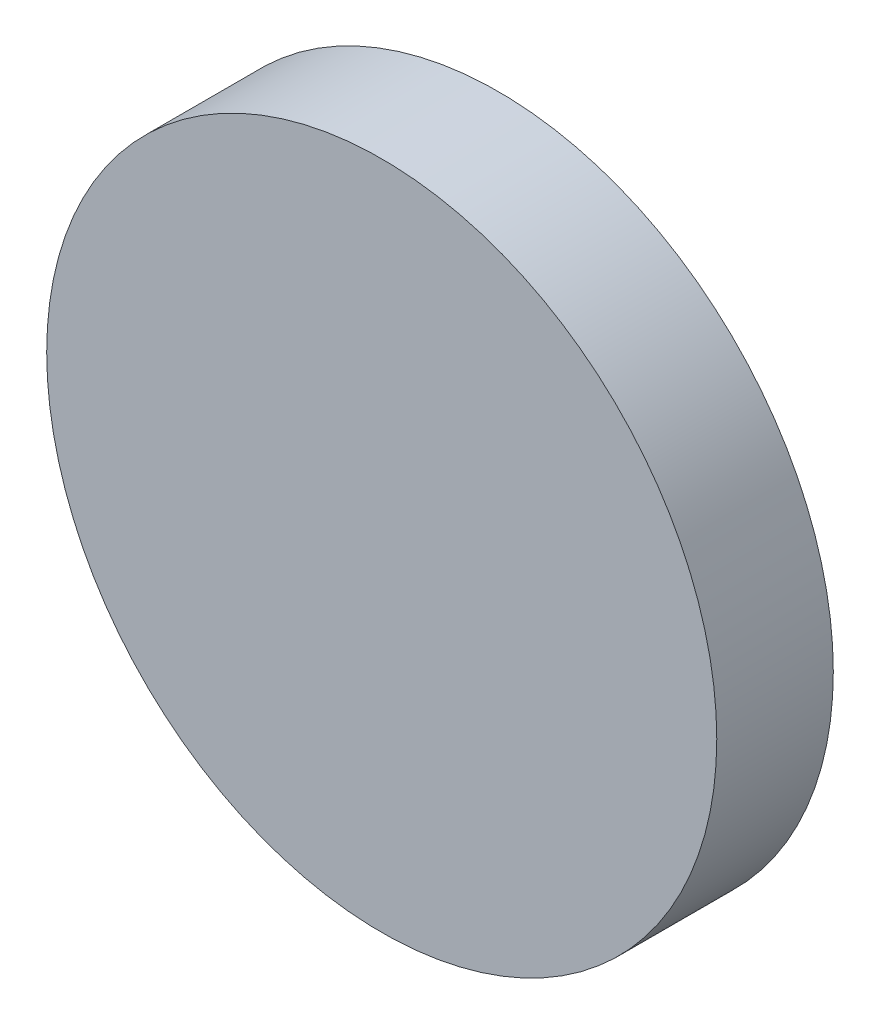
ISO-10303-21;
HEADER;
FILE_DESCRIPTION(('STEP AP214'),'2;1');
FILE_NAME('part.step','',(''),(''),'','','');
FILE_SCHEMA(('AUTOMOTIVE_DESIGN { 1 0 10303 214 1 1 1 1 }'));
ENDSEC;
DATA;
#1=APPLICATION_CONTEXT('core data for automotive mechanical design processes');
#2=APPLICATION_PROTOCOL_DEFINITION('international standard','automotive_design',2000,#1);
#3=PRODUCT_CONTEXT('',#1,'mechanical');
#4=PRODUCT('Part','Part','',(#3));
#5=PRODUCT_RELATED_PRODUCT_CATEGORY('part','',(#4));
#6=PRODUCT_DEFINITION_FORMATION('','',#4);
#7=PRODUCT_DEFINITION_CONTEXT('part definition',#1,'design');
#8=PRODUCT_DEFINITION('design','',#6,#7);
#9=PRODUCT_DEFINITION_SHAPE('','',#8);
#10=(LENGTH_UNIT() NAMED_UNIT(*) SI_UNIT(.MILLI.,.METRE.));
#11=(NAMED_UNIT(*) PLANE_ANGLE_UNIT() SI_UNIT($,.RADIAN.));
#12=(NAMED_UNIT(*) SI_UNIT($,.STERADIAN.) SOLID_ANGLE_UNIT());
#13=UNCERTAINTY_MEASURE_WITH_UNIT(LENGTH_MEASURE(1.E-05),#10,'distance_accuracy_value','');
#14=(GEOMETRIC_REPRESENTATION_CONTEXT(3) GLOBAL_UNCERTAINTY_ASSIGNED_CONTEXT((#13)) GLOBAL_UNIT_ASSIGNED_CONTEXT((#10,
#11,#12)) REPRESENTATION_CONTEXT('',''));
#15=CARTESIAN_POINT('',(0.,0.,0.));
#16=DIRECTION('',(0.,0.,1.));
#17=DIRECTION('',(1.,0.,0.));
#18=AXIS2_PLACEMENT_3D('',#15,#16,#17);
#19=CARTESIAN_POINT('',(0.,0.,8.));
#20=DIRECTION('',(0.,0.,1.));
#21=DIRECTION('',(1.,0.,0.));
#22=AXIS2_PLACEMENT_3D('',#19,#20,#21);
#23=PLANE('',#22);
#24=CARTESIAN_POINT('',(0.,0.,8.));
#25=DIRECTION('',(0.,0.,1.));
#26=DIRECTION('',(1.,0.,0.));
#27=AXIS2_PLACEMENT_3D('',#24,#25,#26);
#28=CIRCLE('',#27,23.);
#29=CARTESIAN_POINT('',(23.,0.,8.));
#30=VERTEX_POINT('',#29);
#31=EDGE_CURVE('E10',#30,#30,#28,.T.);
#32=ORIENTED_EDGE('',*,*,#31,.T.);
#33=EDGE_LOOP('',(#32));
#34=FACE_BOUND('',#33,.T.);
#35=ADVANCED_FACE('F16',(#34),#23,.T.);
#36=CARTESIAN_POINT('',(0.,0.,0.));
#37=DIRECTION('',(0.,0.,1.));
#38=DIRECTION('',(1.,0.,0.));
#39=AXIS2_PLACEMENT_3D('',#36,#37,#38);
#40=PLANE('',#39);
#41=CARTESIAN_POINT('',(0.,0.,0.));
#42=DIRECTION('',(0.,0.,1.));
#43=DIRECTION('',(1.,0.,0.));
#44=AXIS2_PLACEMENT_3D('',#41,#42,#43);
#45=CIRCLE('',#44,23.);
#46=CARTESIAN_POINT('',(23.,0.,0.));
#47=VERTEX_POINT('',#46);
#48=EDGE_CURVE('E41',#47,#47,#45,.T.);
#49=ORIENTED_EDGE('',*,*,#48,.F.);
#50=EDGE_LOOP('',(#49));
#51=FACE_BOUND('',#50,.T.);
#52=ADVANCED_FACE('F55',(#51),#40,.F.);
#53=CARTESIAN_POINT('',(0.,0.,0.));
#54=DIRECTION('',(0.,0.,-1.));
#55=DIRECTION('',(1.,0.,0.));
#56=AXIS2_PLACEMENT_3D('',#53,#54,#55);
#57=CYLINDRICAL_SURFACE('',#56,23.);
#58=ORIENTED_EDGE('',*,*,#48,.T.);
#59=DIRECTION('',(0.,0.,1.));
#60=VECTOR('',#59,1.);
#61=CARTESIAN_POINT('',(23.,0.,0.));
#62=LINE('',#61,#60);
#63=EDGE_CURVE('E24',#47,#30,#62,.T.);
#64=ORIENTED_EDGE('',*,*,#63,.T.);
#65=ORIENTED_EDGE('',*,*,#31,.F.);
#66=ORIENTED_EDGE('',*,*,#63,.F.);
#67=EDGE_LOOP('',(#58,#64,#65,#66));
#68=FACE_BOUND('',#67,.T.);
#69=ADVANCED_FACE('F39',(#68),#57,.T.);
#70=CLOSED_SHELL('',(#35,#52,#69));
#71=MANIFOLD_SOLID_BREP('B1',#70);
#72=ADVANCED_BREP_SHAPE_REPRESENTATION('',(#18,#71),#14);
#73=SHAPE_DEFINITION_REPRESENTATION(#9,#72);
ENDSEC;
END-ISO-10303-21;
